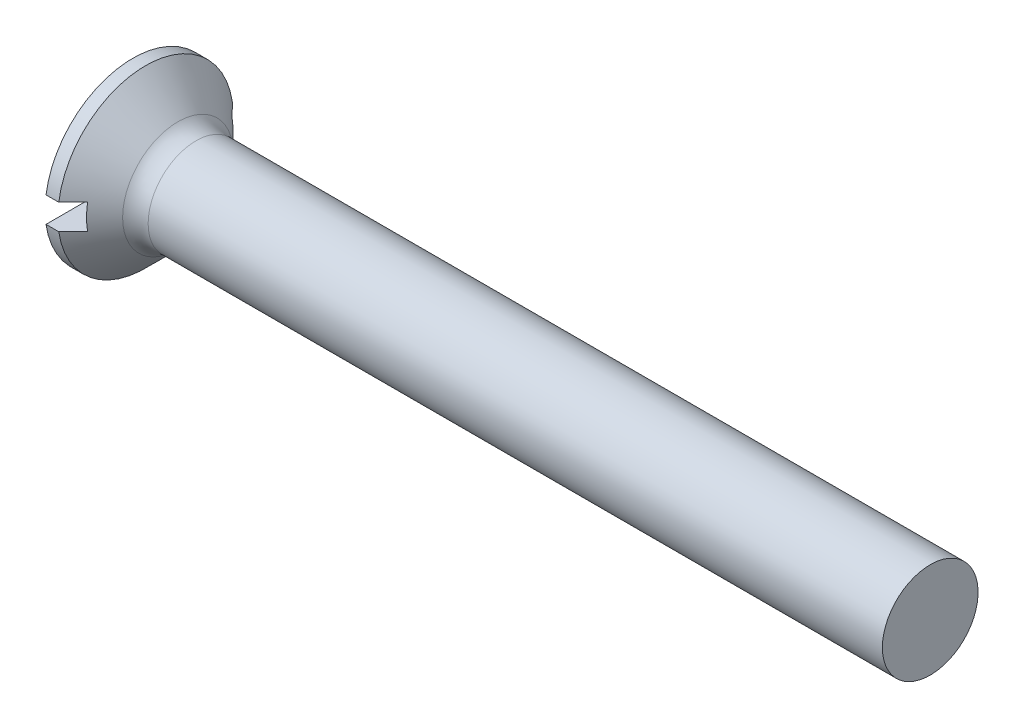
from build123d import *

# Parameters (mm, degrees)
FILLET1_R  = 0.8
SKETCH2_W  = 5.5
SKETCH2_H  = 0.8
SLOT_DEPTH = 0.85


with BuildPart() as part:
    # BodySke → Base-Revolve (revolve)
    with BuildSketch(Plane.XY, mode=Mode.PRIVATE) as base_revolve_sk:
        Polygon((0, 0), (0, 2.75), (0.4, 2.75), (1.65, 1.5), (25, 1.5), (25, 0), align=None)
    revolve(base_revolve_sk.sketch.rotate(Axis((-6.35, 0, 0), (1, 0, 0)), 90), axis=Axis((-6.35, 0, 0), (1, 0, 0)))

    # Fillet1
    fillet1_edges = [part.edges().sort_by_distance(p)[0] for p in [
        (1.65, 0, -1.5),
    ]]
    fillet(fillet1_edges, radius=FILLET1_R)

    # Sketch2 → Slot (cut)
    with BuildSketch(Plane.ZY):
        Rectangle(SKETCH2_W, SKETCH2_H)
    extrude(amount=-SLOT_DEPTH, mode=Mode.SUBTRACT)


solid = part.part
